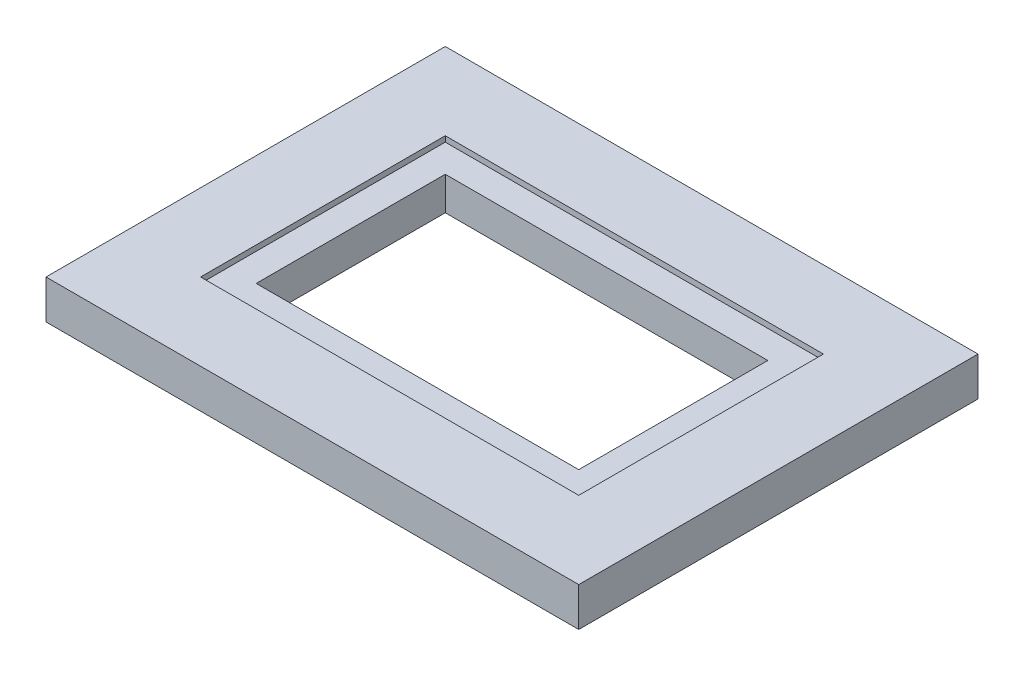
from build123d import *

# Parameters (mm, degrees)
SKETCH1_W           = 304.15
SKETCH1_H           = 227.95
SKETCH1_W_2         = 184.15
SKETCH1_H_2         = 107.95
BOSS_EXTRUDE1_DEPTH = 19.05
SKETCH2_W           = 304.15
SKETCH2_H           = 227.95
SKETCH2_W_2         = 215.9
SKETCH2_H_2         = 139.7
BOSS_EXTRUDE2_DEPTH = 3.18


with BuildPart() as part:
    # Sketch1 → Boss-Extrude1 (new body)
    with BuildSketch(Plane(origin=(0, 0, 0), x_dir=(1, 0, 0), z_dir=(0, 1, 0))):
        Rectangle(SKETCH1_W, SKETCH1_H)
        Rectangle(SKETCH1_W_2, SKETCH1_H_2, mode=Mode.SUBTRACT)
    extrude(amount=BOSS_EXTRUDE1_DEPTH)

    # Sketch2 → Boss-Extrude2 (add)
    with BuildSketch(Plane(origin=(0, 22.23, 0), x_dir=(1, 0, 0), z_dir=(0, 1, 0))):
        Rectangle(SKETCH2_W, SKETCH2_H)
        Rectangle(SKETCH2_W_2, SKETCH2_H_2, mode=Mode.SUBTRACT)
    extrude(amount=-BOSS_EXTRUDE2_DEPTH)


solid = part.part
